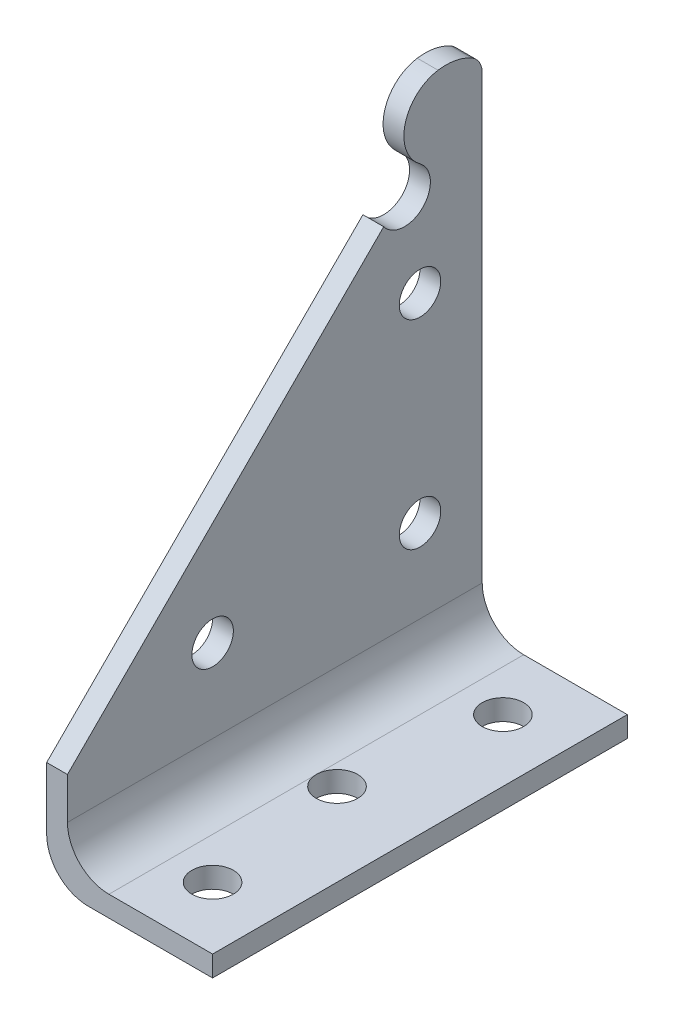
ISO-10303-21;
HEADER;
FILE_DESCRIPTION(('STEP AP214'),'2;1');
FILE_NAME('part.step','',(''),(''),'','','');
FILE_SCHEMA(('AUTOMOTIVE_DESIGN { 1 0 10303 214 1 1 1 1 }'));
ENDSEC;
DATA;
#1=APPLICATION_CONTEXT('core data for automotive mechanical design processes');
#2=APPLICATION_PROTOCOL_DEFINITION('international standard','automotive_design',2000,#1);
#3=PRODUCT_CONTEXT('',#1,'mechanical');
#4=PRODUCT('Part','Part','',(#3));
#5=PRODUCT_RELATED_PRODUCT_CATEGORY('part','',(#4));
#6=PRODUCT_DEFINITION_FORMATION('','',#4);
#7=PRODUCT_DEFINITION_CONTEXT('part definition',#1,'design');
#8=PRODUCT_DEFINITION('design','',#6,#7);
#9=PRODUCT_DEFINITION_SHAPE('','',#8);
#10=(LENGTH_UNIT() NAMED_UNIT(*) SI_UNIT(.MILLI.,.METRE.));
#11=(NAMED_UNIT(*) PLANE_ANGLE_UNIT() SI_UNIT($,.RADIAN.));
#12=(NAMED_UNIT(*) SI_UNIT($,.STERADIAN.) SOLID_ANGLE_UNIT());
#13=UNCERTAINTY_MEASURE_WITH_UNIT(LENGTH_MEASURE(1.E-05),#10,'distance_accuracy_value','');
#14=(GEOMETRIC_REPRESENTATION_CONTEXT(3) GLOBAL_UNCERTAINTY_ASSIGNED_CONTEXT((#13)) GLOBAL_UNIT_ASSIGNED_CONTEXT((#10,
#11,#12)) REPRESENTATION_CONTEXT('',''));
#15=CARTESIAN_POINT('',(0.,0.,0.));
#16=DIRECTION('',(0.,0.,1.));
#17=DIRECTION('',(1.,0.,0.));
#18=AXIS2_PLACEMENT_3D('',#15,#16,#17);
#19=CARTESIAN_POINT('',(3.18262,81.28,-31.75));
#20=DIRECTION('',(-1.,0.,0.));
#21=DIRECTION('',(0.,-1.,0.));
#22=AXIS2_PLACEMENT_3D('',#19,#20,#21);
#23=PLANE('',#22);
#24=CARTESIAN_POINT('',(3.18262000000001,22.225,9.525));
#25=DIRECTION('',(-1.,0.,0.));
#26=DIRECTION('',(0.,1.,0.));
#27=AXIS2_PLACEMENT_3D('',#24,#25,#26);
#28=CIRCLE('',#27,3.175);
#29=CARTESIAN_POINT('',(3.18262000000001,25.4,9.525));
#30=VERTEX_POINT('',#29);
#31=EDGE_CURVE('E520',#30,#30,#28,.T.);
#32=ORIENTED_EDGE('',*,*,#31,.T.);
#33=EDGE_LOOP('',(#32));
#34=FACE_BOUND('',#33,.T.);
#35=CARTESIAN_POINT('',(3.18262000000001,22.225,-22.225));
#36=DIRECTION('',(-1.,0.,0.));
#37=DIRECTION('',(0.,1.,0.));
#38=AXIS2_PLACEMENT_3D('',#35,#36,#37);
#39=CIRCLE('',#38,3.175);
#40=CARTESIAN_POINT('',(3.18262000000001,25.4,-22.225));
#41=VERTEX_POINT('',#40);
#42=EDGE_CURVE('E527',#41,#41,#39,.T.);
#43=ORIENTED_EDGE('',*,*,#42,.T.);
#44=EDGE_LOOP('',(#43));
#45=FACE_BOUND('',#44,.T.);
#46=CARTESIAN_POINT('',(3.18262,52.705,-22.225));
#47=DIRECTION('',(-1.,0.,0.));
#48=DIRECTION('',(0.,1.,0.));
#49=AXIS2_PLACEMENT_3D('',#46,#47,#48);
#50=CIRCLE('',#49,3.175);
#51=CARTESIAN_POINT('',(3.18262,55.88,-22.225));
#52=VERTEX_POINT('',#51);
#53=EDGE_CURVE('E532',#52,#52,#50,.T.);
#54=ORIENTED_EDGE('',*,*,#53,.T.);
#55=EDGE_LOOP('',(#54));
#56=FACE_BOUND('',#55,.T.);
#57=DIRECTION('',(0.,0.707106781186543,-0.707106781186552));
#58=VECTOR('',#57,1.);
#59=CARTESIAN_POINT('',(3.18262000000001,23.8125000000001,23.8124999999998));
#60=LINE('',#59,#58);
#61=CARTESIAN_POINT('',(3.18262000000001,15.875,31.75));
#62=VERTEX_POINT('',#61);
#63=CARTESIAN_POINT('',(3.18262,64.2944757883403,-16.6694757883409));
#64=VERTEX_POINT('',#63);
#65=EDGE_CURVE('E259',#62,#64,#60,.T.);
#66=ORIENTED_EDGE('',*,*,#65,.F.);
#67=DIRECTION('',(0.,1.,0.));
#68=VECTOR('',#67,1.);
#69=CARTESIAN_POINT('',(3.18262,81.28,31.75));
#70=LINE('',#69,#68);
#71=CARTESIAN_POINT('',(3.18262000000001,9.52499999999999,31.75));
#72=VERTEX_POINT('',#71);
#73=EDGE_CURVE('E257',#72,#62,#70,.T.);
#74=ORIENTED_EDGE('',*,*,#73,.F.);
#75=DIRECTION('',(0.,0.,1.));
#76=VECTOR('',#75,1.);
#77=CARTESIAN_POINT('',(3.18262000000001,9.52499999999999,31.75));
#78=LINE('',#77,#76);
#79=CARTESIAN_POINT('',(3.18262000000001,9.52499999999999,-31.75));
#80=VERTEX_POINT('',#79);
#81=EDGE_CURVE('E231',#80,#72,#78,.T.);
#82=ORIENTED_EDGE('',*,*,#81,.F.);
#83=DIRECTION('',(0.,1.,0.));
#84=VECTOR('',#83,1.);
#85=CARTESIAN_POINT('',(3.18262,81.28,-31.75));
#86=LINE('',#85,#84);
#87=CARTESIAN_POINT('',(3.18262,77.1624497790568,-31.75));
#88=VERTEX_POINT('',#87);
#89=EDGE_CURVE('E247',#80,#88,#86,.T.);
#90=ORIENTED_EDGE('',*,*,#89,.T.);
#91=CARTESIAN_POINT('',(3.18262,77.1624497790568,-28.570879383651));
#92=DIRECTION('',(-1.,0.,0.));
#93=DIRECTION('',(0.,1.,0.));
#94=AXIS2_PLACEMENT_3D('',#91,#92,#93);
#95=CIRCLE('',#94,3.17912061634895);
#96=CARTESIAN_POINT('',(3.18262,79.9193630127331,-30.1539893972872));
#97=VERTEX_POINT('',#96);
#98=EDGE_CURVE('E337',#97,#88,#95,.T.);
#99=ORIENTED_EDGE('',*,*,#98,.F.);
#100=CARTESIAN_POINT('',(3.18262,73.025,-26.19502));
#101=DIRECTION('',(-1.,0.,0.));
#102=DIRECTION('',(0.,1.,0.));
#103=AXIS2_PLACEMENT_3D('',#100,#101,#102);
#104=CIRCLE('',#103,7.9502);
#105=CARTESIAN_POINT('',(3.18262,80.8837240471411,-24.9924658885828));
#106=VERTEX_POINT('',#105);
#107=EDGE_CURVE('E340',#106,#97,#104,.T.);
#108=ORIENTED_EDGE('',*,*,#107,.F.);
#109=CARTESIAN_POINT('',(3.18262,74.7861943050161,-25.9255193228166));
#110=DIRECTION('',(-1.,0.,0.));
#111=DIRECTION('',(0.,1.,0.));
#112=AXIS2_PLACEMENT_3D('',#109,#110,#111);
#113=CIRCLE('',#112,6.16850530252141);
#114=CARTESIAN_POINT('',(3.18262,69.8505442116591,-22.2255442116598));
#115=VERTEX_POINT('',#114);
#116=EDGE_CURVE('E343',#115,#106,#113,.T.);
#117=ORIENTED_EDGE('',*,*,#116,.F.);
#118=CARTESIAN_POINT('',(3.18262,66.675,-19.84502));
#119=DIRECTION('',(-1.,0.,0.));
#120=DIRECTION('',(0.,1.,0.));
#121=AXIS2_PLACEMENT_3D('',#118,#119,#120);
#122=CIRCLE('',#121,3.96874999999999);
#123=EDGE_CURVE('E328',#115,#64,#122,.T.);
#124=ORIENTED_EDGE('',*,*,#123,.T.);
#125=EDGE_LOOP('',(#66,#74,#82,#90,#99,#108,#117,#124));
#126=FACE_BOUND('',#125,.T.);
#127=ADVANCED_FACE('F117',(#34,#45,#56,#126),#23,.F.);
#128=CARTESIAN_POINT('',(0.,0.,-31.75));
#129=DIRECTION('',(1.,0.,0.));
#130=DIRECTION('',(0.,0.,1.));
#131=AXIS2_PLACEMENT_3D('',#128,#129,#130);
#132=PLANE('',#131);
#133=CARTESIAN_POINT('',(0.,22.225,9.525));
#134=DIRECTION('',(-1.,0.,0.));
#135=DIRECTION('',(0.,1.,0.));
#136=AXIS2_PLACEMENT_3D('',#133,#134,#135);
#137=CIRCLE('',#136,3.175);
#138=CARTESIAN_POINT('',(0.,25.4,9.525));
#139=VERTEX_POINT('',#138);
#140=EDGE_CURVE('E524',#139,#139,#137,.T.);
#141=ORIENTED_EDGE('',*,*,#140,.F.);
#142=EDGE_LOOP('',(#141));
#143=FACE_BOUND('',#142,.T.);
#144=CARTESIAN_POINT('',(0.,22.225,-22.225));
#145=DIRECTION('',(-1.,0.,0.));
#146=DIRECTION('',(0.,1.,0.));
#147=AXIS2_PLACEMENT_3D('',#144,#145,#146);
#148=CIRCLE('',#147,3.175);
#149=CARTESIAN_POINT('',(0.,25.4,-22.225));
#150=VERTEX_POINT('',#149);
#151=EDGE_CURVE('E529',#150,#150,#148,.T.);
#152=ORIENTED_EDGE('',*,*,#151,.F.);
#153=EDGE_LOOP('',(#152));
#154=FACE_BOUND('',#153,.T.);
#155=CARTESIAN_POINT('',(0.,52.705,-22.225));
#156=DIRECTION('',(-1.,0.,0.));
#157=DIRECTION('',(0.,1.,0.));
#158=AXIS2_PLACEMENT_3D('',#155,#156,#157);
#159=CIRCLE('',#158,3.175);
#160=CARTESIAN_POINT('',(0.,55.88,-22.225));
#161=VERTEX_POINT('',#160);
#162=EDGE_CURVE('E338',#161,#161,#159,.T.);
#163=ORIENTED_EDGE('',*,*,#162,.F.);
#164=EDGE_LOOP('',(#163));
#165=FACE_BOUND('',#164,.T.);
#166=DIRECTION('',(0.,0.707106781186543,-0.707106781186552));
#167=VECTOR('',#166,1.);
#168=CARTESIAN_POINT('',(0.,23.8125000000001,23.8124999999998));
#169=LINE('',#168,#167);
#170=CARTESIAN_POINT('',(0.,15.875,31.75));
#171=VERTEX_POINT('',#170);
#172=CARTESIAN_POINT('',(0.,64.2944757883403,-16.6694757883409));
#173=VERTEX_POINT('',#172);
#174=EDGE_CURVE('E324',#171,#173,#169,.T.);
#175=ORIENTED_EDGE('',*,*,#174,.T.);
#176=CARTESIAN_POINT('',(0.,66.675,-19.84502));
#177=DIRECTION('',(-1.,0.,0.));
#178=DIRECTION('',(0.,1.,0.));
#179=AXIS2_PLACEMENT_3D('',#176,#177,#178);
#180=CIRCLE('',#179,3.96874999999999);
#181=CARTESIAN_POINT('',(0.,69.8505442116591,-22.2255442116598));
#182=VERTEX_POINT('',#181);
#183=EDGE_CURVE('E333',#182,#173,#180,.T.);
#184=ORIENTED_EDGE('',*,*,#183,.F.);
#185=CARTESIAN_POINT('',(0.,74.7861943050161,-25.9255193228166));
#186=DIRECTION('',(-1.,0.,0.));
#187=DIRECTION('',(0.,1.,0.));
#188=AXIS2_PLACEMENT_3D('',#185,#186,#187);
#189=CIRCLE('',#188,6.16850530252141);
#190=CARTESIAN_POINT('',(0.,80.8837240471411,-24.9924658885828));
#191=VERTEX_POINT('',#190);
#192=EDGE_CURVE('E326',#182,#191,#189,.T.);
#193=ORIENTED_EDGE('',*,*,#192,.T.);
#194=CARTESIAN_POINT('',(0.,73.025,-26.19502));
#195=DIRECTION('',(-1.,0.,0.));
#196=DIRECTION('',(0.,1.,0.));
#197=AXIS2_PLACEMENT_3D('',#194,#195,#196);
#198=CIRCLE('',#197,7.9502);
#199=CARTESIAN_POINT('',(0.,79.9193630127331,-30.1539893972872));
#200=VERTEX_POINT('',#199);
#201=EDGE_CURVE('E322',#191,#200,#198,.T.);
#202=ORIENTED_EDGE('',*,*,#201,.T.);
#203=CARTESIAN_POINT('',(0.,77.1624497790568,-28.570879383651));
#204=DIRECTION('',(-1.,0.,0.));
#205=DIRECTION('',(0.,1.,0.));
#206=AXIS2_PLACEMENT_3D('',#203,#204,#205);
#207=CIRCLE('',#206,3.17912061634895);
#208=CARTESIAN_POINT('',(0.,77.1624497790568,-31.75));
#209=VERTEX_POINT('',#208);
#210=EDGE_CURVE('E319',#200,#209,#207,.T.);
#211=ORIENTED_EDGE('',*,*,#210,.T.);
#212=DIRECTION('',(0.,-1.,0.));
#213=VECTOR('',#212,1.);
#214=CARTESIAN_POINT('',(0.,0.,-31.75));
#215=LINE('',#214,#213);
#216=CARTESIAN_POINT('',(0.,6.35,-31.75));
#217=VERTEX_POINT('',#216);
#218=EDGE_CURVE('E254',#209,#217,#215,.T.);
#219=ORIENTED_EDGE('',*,*,#218,.T.);
#220=DIRECTION('',(0.,0.,1.));
#221=VECTOR('',#220,1.);
#222=CARTESIAN_POINT('',(0.,6.35,-31.75));
#223=LINE('',#222,#221);
#224=CARTESIAN_POINT('',(0.,6.35,31.75));
#225=VERTEX_POINT('',#224);
#226=EDGE_CURVE('E280',#225,#217,#223,.F.);
#227=ORIENTED_EDGE('',*,*,#226,.F.);
#228=DIRECTION('',(0.,-1.,0.));
#229=VECTOR('',#228,1.);
#230=CARTESIAN_POINT('',(0.,0.,31.75));
#231=LINE('',#230,#229);
#232=EDGE_CURVE('E261',#171,#225,#231,.T.);
#233=ORIENTED_EDGE('',*,*,#232,.F.);
#234=EDGE_LOOP('',(#175,#184,#193,#202,#211,#219,#227,#233));
#235=FACE_BOUND('',#234,.T.);
#236=ADVANCED_FACE('F315',(#143,#154,#165,#235),#132,.F.);
#237=CARTESIAN_POINT('',(0.,0.,-31.75));
#238=DIRECTION('',(0.,0.,1.));
#239=DIRECTION('',(-1.,0.,0.));
#240=AXIS2_PLACEMENT_3D('',#237,#238,#239);
#241=PLANE('',#240);
#242=DIRECTION('',(1.,0.,0.));
#243=VECTOR('',#242,1.);
#244=CARTESIAN_POINT('',(0.,77.1624497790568,-31.75));
#245=LINE('',#244,#243);
#246=EDGE_CURVE('E250',#209,#88,#245,.T.);
#247=ORIENTED_EDGE('',*,*,#246,.T.);
#248=ORIENTED_EDGE('',*,*,#89,.F.);
#249=CARTESIAN_POINT('',(9.53262000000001,9.52499999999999,-31.75));
#250=DIRECTION('',(0.,0.,-1.));
#251=DIRECTION('',(-1.,0.,0.));
#252=AXIS2_PLACEMENT_3D('',#249,#250,#251);
#253=CIRCLE('',#252,6.35);
#254=CARTESIAN_POINT('',(9.53262000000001,3.175,-31.75));
#255=VERTEX_POINT('',#254);
#256=EDGE_CURVE('E128',#255,#80,#253,.T.);
#257=ORIENTED_EDGE('',*,*,#256,.F.);
#258=DIRECTION('',(-1.,0.,0.));
#259=VECTOR('',#258,1.);
#260=CARTESIAN_POINT('',(3.18262000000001,3.175,-31.75));
#261=LINE('',#260,#259);
#262=CARTESIAN_POINT('',(25.4,3.175,-31.75));
#263=VERTEX_POINT('',#262);
#264=EDGE_CURVE('E229',#263,#255,#261,.T.);
#265=ORIENTED_EDGE('',*,*,#264,.F.);
#266=DIRECTION('',(0.,1.,0.));
#267=VECTOR('',#266,1.);
#268=CARTESIAN_POINT('',(25.4,3.175,-31.75));
#269=LINE('',#268,#267);
#270=CARTESIAN_POINT('',(25.4,0.,-31.75));
#271=VERTEX_POINT('',#270);
#272=EDGE_CURVE('E292',#271,#263,#269,.T.);
#273=ORIENTED_EDGE('',*,*,#272,.F.);
#274=DIRECTION('',(1.,0.,0.));
#275=VECTOR('',#274,1.);
#276=CARTESIAN_POINT('',(25.4,0.,-31.75));
#277=LINE('',#276,#275);
#278=CARTESIAN_POINT('',(6.35,0.,-31.75));
#279=VERTEX_POINT('',#278);
#280=EDGE_CURVE('E265',#279,#271,#277,.T.);
#281=ORIENTED_EDGE('',*,*,#280,.F.);
#282=CARTESIAN_POINT('',(6.35,6.35,-31.75));
#283=DIRECTION('',(0.,0.,-1.));
#284=DIRECTION('',(-1.,0.,0.));
#285=AXIS2_PLACEMENT_3D('',#282,#283,#284);
#286=CIRCLE('',#285,6.35);
#287=EDGE_CURVE('E234',#217,#279,#286,.F.);
#288=ORIENTED_EDGE('',*,*,#287,.F.);
#289=ORIENTED_EDGE('',*,*,#218,.F.);
#290=EDGE_LOOP('',(#247,#248,#257,#265,#273,#281,#288,#289));
#291=FACE_BOUND('',#290,.T.);
#292=ADVANCED_FACE('F248',(#291),#241,.F.);
#293=CARTESIAN_POINT('',(0.,0.,31.75));
#294=DIRECTION('',(0.,0.,1.));
#295=DIRECTION('',(-1.,0.,0.));
#296=AXIS2_PLACEMENT_3D('',#293,#294,#295);
#297=PLANE('',#296);
#298=ORIENTED_EDGE('',*,*,#232,.T.);
#299=CARTESIAN_POINT('',(6.35,6.35,31.75));
#300=DIRECTION('',(0.,0.,-1.));
#301=DIRECTION('',(-1.,0.,0.));
#302=AXIS2_PLACEMENT_3D('',#299,#300,#301);
#303=CIRCLE('',#302,6.35);
#304=CARTESIAN_POINT('',(6.35,0.,31.75));
#305=VERTEX_POINT('',#304);
#306=EDGE_CURVE('E278',#305,#225,#303,.T.);
#307=ORIENTED_EDGE('',*,*,#306,.F.);
#308=DIRECTION('',(1.,0.,0.));
#309=VECTOR('',#308,1.);
#310=CARTESIAN_POINT('',(25.4,0.,31.75));
#311=LINE('',#310,#309);
#312=CARTESIAN_POINT('',(25.4,0.,31.75));
#313=VERTEX_POINT('',#312);
#314=EDGE_CURVE('E301',#305,#313,#311,.T.);
#315=ORIENTED_EDGE('',*,*,#314,.T.);
#316=DIRECTION('',(0.,1.,0.));
#317=VECTOR('',#316,1.);
#318=CARTESIAN_POINT('',(25.4,3.175,31.75));
#319=LINE('',#318,#317);
#320=CARTESIAN_POINT('',(25.4,3.175,31.75));
#321=VERTEX_POINT('',#320);
#322=EDGE_CURVE('E268',#313,#321,#319,.T.);
#323=ORIENTED_EDGE('',*,*,#322,.T.);
#324=DIRECTION('',(-1.,0.,0.));
#325=VECTOR('',#324,1.);
#326=CARTESIAN_POINT('',(3.18262000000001,3.175,31.75));
#327=LINE('',#326,#325);
#328=CARTESIAN_POINT('',(9.53262000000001,3.175,31.75));
#329=VERTEX_POINT('',#328);
#330=EDGE_CURVE('E262',#321,#329,#327,.T.);
#331=ORIENTED_EDGE('',*,*,#330,.T.);
#332=CARTESIAN_POINT('',(9.53262000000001,9.52499999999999,31.75));
#333=DIRECTION('',(0.,0.,-1.));
#334=DIRECTION('',(-1.,0.,0.));
#335=AXIS2_PLACEMENT_3D('',#332,#333,#334);
#336=CIRCLE('',#335,6.35);
#337=EDGE_CURVE('E232',#72,#329,#336,.F.);
#338=ORIENTED_EDGE('',*,*,#337,.F.);
#339=ORIENTED_EDGE('',*,*,#73,.T.);
#340=DIRECTION('',(1.,0.,0.));
#341=VECTOR('',#340,1.);
#342=CARTESIAN_POINT('',(0.,15.875,31.75));
#343=LINE('',#342,#341);
#344=EDGE_CURVE('E141',#171,#62,#343,.T.);
#345=ORIENTED_EDGE('',*,*,#344,.F.);
#346=EDGE_LOOP('',(#298,#307,#315,#323,#331,#338,#339,#345));
#347=FACE_BOUND('',#346,.T.);
#348=ADVANCED_FACE('F306',(#347),#297,.T.);
#349=CARTESIAN_POINT('',(25.4,0.,-31.75));
#350=DIRECTION('',(0.,1.,0.));
#351=DIRECTION('',(-1.,0.,0.));
#352=AXIS2_PLACEMENT_3D('',#349,#350,#351);
#353=PLANE('',#352);
#354=CARTESIAN_POINT('',(15.875,0.,22.225));
#355=DIRECTION('',(0.,-1.,0.));
#356=DIRECTION('',(-1.,0.,0.));
#357=AXIS2_PLACEMENT_3D('',#354,#355,#356);
#358=CIRCLE('',#357,3.175);
#359=CARTESIAN_POINT('',(12.7,0.,22.225));
#360=VERTEX_POINT('',#359);
#361=EDGE_CURVE('E225',#360,#360,#358,.T.);
#362=ORIENTED_EDGE('',*,*,#361,.F.);
#363=EDGE_LOOP('',(#362));
#364=FACE_BOUND('',#363,.T.);
#365=CARTESIAN_POINT('',(12.7,0.,0.));
#366=DIRECTION('',(0.,-1.,0.));
#367=DIRECTION('',(-1.,0.,0.));
#368=AXIS2_PLACEMENT_3D('',#365,#366,#367);
#369=CIRCLE('',#368,3.175);
#370=CARTESIAN_POINT('',(9.525,0.,0.));
#371=VERTEX_POINT('',#370);
#372=EDGE_CURVE('E224',#371,#371,#369,.T.);
#373=ORIENTED_EDGE('',*,*,#372,.F.);
#374=EDGE_LOOP('',(#373));
#375=FACE_BOUND('',#374,.T.);
#376=CARTESIAN_POINT('',(15.875,0.,-22.225));
#377=DIRECTION('',(0.,-1.,0.));
#378=DIRECTION('',(-1.,0.,0.));
#379=AXIS2_PLACEMENT_3D('',#376,#377,#378);
#380=CIRCLE('',#379,3.175);
#381=CARTESIAN_POINT('',(12.7,0.,-22.225));
#382=VERTEX_POINT('',#381);
#383=EDGE_CURVE('E517',#382,#382,#380,.T.);
#384=ORIENTED_EDGE('',*,*,#383,.F.);
#385=EDGE_LOOP('',(#384));
#386=FACE_BOUND('',#385,.T.);
#387=ORIENTED_EDGE('',*,*,#280,.T.);
#388=DIRECTION('',(0.,0.,1.));
#389=VECTOR('',#388,1.);
#390=CARTESIAN_POINT('',(25.4,0.,-31.75));
#391=LINE('',#390,#389);
#392=EDGE_CURVE('E274',#271,#313,#391,.T.);
#393=ORIENTED_EDGE('',*,*,#392,.T.);
#394=ORIENTED_EDGE('',*,*,#314,.F.);
#395=DIRECTION('',(0.,0.,1.));
#396=VECTOR('',#395,1.);
#397=CARTESIAN_POINT('',(6.35,0.,-31.75));
#398=LINE('',#397,#396);
#399=EDGE_CURVE('E276',#279,#305,#398,.T.);
#400=ORIENTED_EDGE('',*,*,#399,.F.);
#401=EDGE_LOOP('',(#387,#393,#394,#400));
#402=FACE_BOUND('',#401,.T.);
#403=ADVANCED_FACE('F311',(#364,#375,#386,#402),#353,.F.);
#404=CARTESIAN_POINT('',(25.4,3.175,-31.75));
#405=DIRECTION('',(-1.,0.,0.));
#406=DIRECTION('',(0.,0.,-1.));
#407=AXIS2_PLACEMENT_3D('',#404,#405,#406);
#408=PLANE('',#407);
#409=ORIENTED_EDGE('',*,*,#322,.F.);
#410=ORIENTED_EDGE('',*,*,#392,.F.);
#411=ORIENTED_EDGE('',*,*,#272,.T.);
#412=DIRECTION('',(0.,0.,1.));
#413=VECTOR('',#412,1.);
#414=CARTESIAN_POINT('',(25.4,3.175,-31.75));
#415=LINE('',#414,#413);
#416=EDGE_CURVE('E272',#263,#321,#415,.T.);
#417=ORIENTED_EDGE('',*,*,#416,.T.);
#418=EDGE_LOOP('',(#409,#410,#411,#417));
#419=FACE_BOUND('',#418,.T.);
#420=ADVANCED_FACE('F310',(#419),#408,.F.);
#421=CARTESIAN_POINT('',(3.18262000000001,3.175,-31.75));
#422=DIRECTION('',(0.,-1.,0.));
#423=DIRECTION('',(1.,0.,0.));
#424=AXIS2_PLACEMENT_3D('',#421,#422,#423);
#425=PLANE('',#424);
#426=CARTESIAN_POINT('',(15.875,3.175,22.225));
#427=DIRECTION('',(0.,-1.,0.));
#428=DIRECTION('',(-1.,0.,0.));
#429=AXIS2_PLACEMENT_3D('',#426,#427,#428);
#430=CIRCLE('',#429,3.175);
#431=CARTESIAN_POINT('',(12.7,3.175,22.225));
#432=VERTEX_POINT('',#431);
#433=EDGE_CURVE('E554',#432,#432,#430,.T.);
#434=ORIENTED_EDGE('',*,*,#433,.T.);
#435=EDGE_LOOP('',(#434));
#436=FACE_BOUND('',#435,.T.);
#437=CARTESIAN_POINT('',(15.875,3.175,-22.225));
#438=DIRECTION('',(0.,-1.,0.));
#439=DIRECTION('',(-1.,0.,0.));
#440=AXIS2_PLACEMENT_3D('',#437,#438,#439);
#441=CIRCLE('',#440,3.175);
#442=CARTESIAN_POINT('',(12.7,3.175,-22.225));
#443=VERTEX_POINT('',#442);
#444=EDGE_CURVE('E521',#443,#443,#441,.T.);
#445=ORIENTED_EDGE('',*,*,#444,.T.);
#446=EDGE_LOOP('',(#445));
#447=FACE_BOUND('',#446,.T.);
#448=DIRECTION('',(0.,0.,1.));
#449=VECTOR('',#448,1.);
#450=CARTESIAN_POINT('',(9.53262000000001,3.175,-31.75));
#451=LINE('',#450,#449);
#452=CARTESIAN_POINT('',(9.53262000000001,3.175,0.219838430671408));
#453=VERTEX_POINT('',#452);
#454=EDGE_CURVE('E122',#329,#453,#451,.F.);
#455=ORIENTED_EDGE('',*,*,#454,.F.);
#456=ORIENTED_EDGE('',*,*,#330,.F.);
#457=ORIENTED_EDGE('',*,*,#416,.F.);
#458=ORIENTED_EDGE('',*,*,#264,.T.);
#459=CARTESIAN_POINT('',(9.53262000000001,3.175,-0.21983843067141));
#460=VERTEX_POINT('',#459);
#461=EDGE_CURVE('E216',#460,#255,#451,.F.);
#462=ORIENTED_EDGE('',*,*,#461,.F.);
#463=CARTESIAN_POINT('',(12.7,3.175,0.));
#464=DIRECTION('',(0.,-1.,0.));
#465=DIRECTION('',(-1.,0.,0.));
#466=AXIS2_PLACEMENT_3D('',#463,#464,#465);
#467=CIRCLE('',#466,3.175);
#468=EDGE_CURVE('E221',#460,#453,#467,.T.);
#469=ORIENTED_EDGE('',*,*,#468,.T.);
#470=EDGE_LOOP('',(#455,#456,#457,#458,#462,#469));
#471=FACE_BOUND('',#470,.T.);
#472=ADVANCED_FACE('F227',(#436,#447,#471),#425,.F.);
#473=CARTESIAN_POINT('',(6.35,6.35,-31.75));
#474=DIRECTION('',(0.,0.,1.));
#475=DIRECTION('',(-1.,0.,0.));
#476=AXIS2_PLACEMENT_3D('',#473,#474,#475);
#477=CYLINDRICAL_SURFACE('',#476,6.35);
#478=ORIENTED_EDGE('',*,*,#287,.T.);
#479=ORIENTED_EDGE('',*,*,#399,.T.);
#480=ORIENTED_EDGE('',*,*,#306,.T.);
#481=ORIENTED_EDGE('',*,*,#226,.T.);
#482=EDGE_LOOP('',(#478,#479,#480,#481));
#483=FACE_BOUND('',#482,.T.);
#484=ADVANCED_FACE('F285',(#483),#477,.T.);
#485=CARTESIAN_POINT('',(9.53262000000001,9.52499999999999,-31.75));
#486=DIRECTION('',(0.,0.,-1.));
#487=DIRECTION('',(1.,0.,0.));
#488=AXIS2_PLACEMENT_3D('',#485,#486,#487);
#489=CYLINDRICAL_SURFACE('',#488,6.35);
#490=ORIENTED_EDGE('',*,*,#461,.T.);
#491=ORIENTED_EDGE('',*,*,#256,.T.);
#492=ORIENTED_EDGE('',*,*,#81,.T.);
#493=ORIENTED_EDGE('',*,*,#337,.T.);
#494=ORIENTED_EDGE('',*,*,#454,.T.);
#495=CARTESIAN_POINT('',(9.53262000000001,3.17499999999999,0.219838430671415));
#496=CARTESIAN_POINT('',(9.53134910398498,3.17500002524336,0.201528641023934));
#497=CARTESIAN_POINT('',(9.53023634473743,3.17500038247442,0.183207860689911));
#498=CARTESIAN_POINT('',(9.52832899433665,3.175001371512,0.146566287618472));
#499=CARTESIAN_POINT('',(9.52753411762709,3.17500200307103,0.128245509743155));
#500=CARTESIAN_POINT('',(9.52626251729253,3.17500315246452,0.0916039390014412));
#501=CARTESIAN_POINT('',(9.52578560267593,3.17500367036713,0.0732831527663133));
#502=CARTESIAN_POINT('',(9.5251498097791,3.17500438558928,0.0366415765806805));
#503=CARTESIAN_POINT('',(9.52499083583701,3.17500458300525,0.0183207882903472));
#504=CARTESIAN_POINT('',(9.52499083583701,3.17500458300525,-0.0183207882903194));
#505=CARTESIAN_POINT('',(9.5251498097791,3.17500438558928,-0.0366415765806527));
#506=CARTESIAN_POINT('',(9.52578560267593,3.17500367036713,-0.0732831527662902));
#507=CARTESIAN_POINT('',(9.52626251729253,3.17500315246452,-0.0916039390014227));
#508=CARTESIAN_POINT('',(9.52753411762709,3.17500200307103,-0.128245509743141));
#509=CARTESIAN_POINT('',(9.52832899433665,3.175001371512,-0.146566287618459));
#510=CARTESIAN_POINT('',(9.53023634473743,3.17500038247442,-0.183207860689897));
#511=CARTESIAN_POINT('',(9.53134910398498,3.17500002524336,-0.201528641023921));
#512=CARTESIAN_POINT('',(9.53262000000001,3.17499999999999,-0.219838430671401));
#513=B_SPLINE_CURVE_WITH_KNOTS('',3,(#495,#496,#497,#498,#499,#500,#501,#502,#503,#504,#505,
#506,#507,#508,#509,#510,#511,#512),.UNSPECIFIED.,.F.,.F.,(4,2,2,2,2,2,2,2,4),(0.,
0.0550608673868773,0.11007216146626,0.165050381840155,0.220012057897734,0.274973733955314,
0.329951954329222,0.384963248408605,0.440024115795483),.UNSPECIFIED.);
#514=EDGE_CURVE('E12',#453,#460,#513,.T.);
#515=ORIENTED_EDGE('',*,*,#514,.T.);
#516=EDGE_LOOP('',(#490,#491,#492,#493,#494,#515));
#517=FACE_BOUND('',#516,.T.);
#518=ADVANCED_FACE('F119',(#517),#489,.F.);
#519=CARTESIAN_POINT('',(0.,23.8125000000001,23.8124999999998));
#520=DIRECTION('',(0.,0.707106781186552,0.707106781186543));
#521=DIRECTION('',(0.,0.707106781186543,-0.707106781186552));
#522=AXIS2_PLACEMENT_3D('',#519,#520,#521);
#523=PLANE('',#522);
#524=ORIENTED_EDGE('',*,*,#65,.T.);
#525=DIRECTION('',(1.,0.,0.));
#526=VECTOR('',#525,1.);
#527=CARTESIAN_POINT('',(0.,64.2944757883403,-16.6694757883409));
#528=LINE('',#527,#526);
#529=EDGE_CURVE('E303',#173,#64,#528,.T.);
#530=ORIENTED_EDGE('',*,*,#529,.F.);
#531=ORIENTED_EDGE('',*,*,#174,.F.);
#532=ORIENTED_EDGE('',*,*,#344,.T.);
#533=EDGE_LOOP('',(#524,#530,#531,#532));
#534=FACE_BOUND('',#533,.T.);
#535=ADVANCED_FACE('F365',(#534),#523,.T.);
#536=CARTESIAN_POINT('',(0.,66.675,-19.84502));
#537=DIRECTION('',(1.,0.,0.));
#538=DIRECTION('',(0.,1.,0.));
#539=AXIS2_PLACEMENT_3D('',#536,#537,#538);
#540=CYLINDRICAL_SURFACE('',#539,3.96874999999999);
#541=ORIENTED_EDGE('',*,*,#123,.F.);
#542=DIRECTION('',(1.,0.,0.));
#543=VECTOR('',#542,1.);
#544=CARTESIAN_POINT('',(0.,69.8505442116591,-22.2255442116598));
#545=LINE('',#544,#543);
#546=EDGE_CURVE('E348',#182,#115,#545,.T.);
#547=ORIENTED_EDGE('',*,*,#546,.F.);
#548=ORIENTED_EDGE('',*,*,#183,.T.);
#549=ORIENTED_EDGE('',*,*,#529,.T.);
#550=EDGE_LOOP('',(#541,#547,#548,#549));
#551=FACE_BOUND('',#550,.T.);
#552=ADVANCED_FACE('F364',(#551),#540,.F.);
#553=CARTESIAN_POINT('',(0.,74.7861943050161,-25.9255193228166));
#554=DIRECTION('',(1.,0.,0.));
#555=DIRECTION('',(0.,1.,0.));
#556=AXIS2_PLACEMENT_3D('',#553,#554,#555);
#557=CYLINDRICAL_SURFACE('',#556,6.16850530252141);
#558=ORIENTED_EDGE('',*,*,#116,.T.);
#559=DIRECTION('',(1.,0.,0.));
#560=VECTOR('',#559,1.);
#561=CARTESIAN_POINT('',(0.,80.8837240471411,-24.9924658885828));
#562=LINE('',#561,#560);
#563=EDGE_CURVE('E350',#191,#106,#562,.T.);
#564=ORIENTED_EDGE('',*,*,#563,.F.);
#565=ORIENTED_EDGE('',*,*,#192,.F.);
#566=ORIENTED_EDGE('',*,*,#546,.T.);
#567=EDGE_LOOP('',(#558,#564,#565,#566));
#568=FACE_BOUND('',#567,.T.);
#569=ADVANCED_FACE('F360',(#568),#557,.T.);
#570=CARTESIAN_POINT('',(0.,73.025,-26.19502));
#571=DIRECTION('',(1.,0.,0.));
#572=DIRECTION('',(0.,1.,0.));
#573=AXIS2_PLACEMENT_3D('',#570,#571,#572);
#574=CYLINDRICAL_SURFACE('',#573,7.9502);
#575=ORIENTED_EDGE('',*,*,#107,.T.);
#576=DIRECTION('',(1.,0.,0.));
#577=VECTOR('',#576,1.);
#578=CARTESIAN_POINT('',(0.,79.9193630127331,-30.1539893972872));
#579=LINE('',#578,#577);
#580=EDGE_CURVE('E352',#200,#97,#579,.T.);
#581=ORIENTED_EDGE('',*,*,#580,.F.);
#582=ORIENTED_EDGE('',*,*,#201,.F.);
#583=ORIENTED_EDGE('',*,*,#563,.T.);
#584=EDGE_LOOP('',(#575,#581,#582,#583));
#585=FACE_BOUND('',#584,.T.);
#586=ADVANCED_FACE('F356',(#585),#574,.T.);
#587=CARTESIAN_POINT('',(0.,77.1624497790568,-28.570879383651));
#588=DIRECTION('',(1.,0.,0.));
#589=DIRECTION('',(0.,1.,0.));
#590=AXIS2_PLACEMENT_3D('',#587,#588,#589);
#591=CYLINDRICAL_SURFACE('',#590,3.17912061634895);
#592=ORIENTED_EDGE('',*,*,#98,.T.);
#593=ORIENTED_EDGE('',*,*,#246,.F.);
#594=ORIENTED_EDGE('',*,*,#210,.F.);
#595=ORIENTED_EDGE('',*,*,#580,.T.);
#596=EDGE_LOOP('',(#592,#593,#594,#595));
#597=FACE_BOUND('',#596,.T.);
#598=ADVANCED_FACE('F353',(#597),#591,.T.);
#599=CARTESIAN_POINT('',(0.,52.705,-22.225));
#600=DIRECTION('',(1.,0.,0.));
#601=DIRECTION('',(0.,1.,0.));
#602=AXIS2_PLACEMENT_3D('',#599,#600,#601);
#603=CYLINDRICAL_SURFACE('',#602,3.175);
#604=ORIENTED_EDGE('',*,*,#162,.T.);
#605=EDGE_LOOP('',(#604));
#606=FACE_BOUND('',#605,.T.);
#607=ORIENTED_EDGE('',*,*,#53,.F.);
#608=EDGE_LOOP('',(#607));
#609=FACE_BOUND('',#608,.T.);
#610=ADVANCED_FACE('F443',(#606,#609),#603,.F.);
#611=CARTESIAN_POINT('',(0.,22.225,-22.225));
#612=DIRECTION('',(1.,0.,0.));
#613=DIRECTION('',(0.,1.,0.));
#614=AXIS2_PLACEMENT_3D('',#611,#612,#613);
#615=CYLINDRICAL_SURFACE('',#614,3.175);
#616=ORIENTED_EDGE('',*,*,#151,.T.);
#617=EDGE_LOOP('',(#616));
#618=FACE_BOUND('',#617,.T.);
#619=ORIENTED_EDGE('',*,*,#42,.F.);
#620=EDGE_LOOP('',(#619));
#621=FACE_BOUND('',#620,.T.);
#622=ADVANCED_FACE('F450',(#618,#621),#615,.F.);
#623=CARTESIAN_POINT('',(0.,22.225,9.525));
#624=DIRECTION('',(1.,0.,0.));
#625=DIRECTION('',(0.,1.,0.));
#626=AXIS2_PLACEMENT_3D('',#623,#624,#625);
#627=CYLINDRICAL_SURFACE('',#626,3.175);
#628=ORIENTED_EDGE('',*,*,#140,.T.);
#629=EDGE_LOOP('',(#628));
#630=FACE_BOUND('',#629,.T.);
#631=ORIENTED_EDGE('',*,*,#31,.F.);
#632=EDGE_LOOP('',(#631));
#633=FACE_BOUND('',#632,.T.);
#634=ADVANCED_FACE('F460',(#630,#633),#627,.F.);
#635=CARTESIAN_POINT('',(15.875,0.,-22.225));
#636=DIRECTION('',(0.,1.,0.));
#637=DIRECTION('',(-1.,0.,0.));
#638=AXIS2_PLACEMENT_3D('',#635,#636,#637);
#639=CYLINDRICAL_SURFACE('',#638,3.175);
#640=CARTESIAN_POINT('',(12.7,0.,-22.225));
#641=CARTESIAN_POINT('',(12.7,0.0330729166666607,-22.225));
#642=CARTESIAN_POINT('',(12.7,0.0661458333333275,-22.225));
#643=CARTESIAN_POINT('',(12.7,0.132291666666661,-22.225));
#644=CARTESIAN_POINT('',(12.7,0.165364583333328,-22.225));
#645=CARTESIAN_POINT('',(12.7,0.231510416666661,-22.225));
#646=CARTESIAN_POINT('',(12.7,0.264583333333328,-22.225));
#647=CARTESIAN_POINT('',(12.7,0.330729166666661,-22.225));
#648=CARTESIAN_POINT('',(12.7,0.363802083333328,-22.225));
#649=CARTESIAN_POINT('',(12.7,0.429947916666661,-22.225));
#650=CARTESIAN_POINT('',(12.7,0.463020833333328,-22.225));
#651=CARTESIAN_POINT('',(12.7,0.529166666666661,-22.225));
#652=CARTESIAN_POINT('',(12.7,0.562239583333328,-22.225));
#653=CARTESIAN_POINT('',(12.7,0.628385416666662,-22.225));
#654=CARTESIAN_POINT('',(12.7,0.661458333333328,-22.225));
#655=CARTESIAN_POINT('',(12.7,0.727604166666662,-22.225));
#656=CARTESIAN_POINT('',(12.7,0.760677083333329,-22.225));
#657=CARTESIAN_POINT('',(12.7,0.826822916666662,-22.225));
#658=CARTESIAN_POINT('',(12.7,0.859895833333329,-22.225));
#659=CARTESIAN_POINT('',(12.7,0.926041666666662,-22.225));
#660=CARTESIAN_POINT('',(12.7,0.959114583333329,-22.225));
#661=CARTESIAN_POINT('',(12.7,1.02526041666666,-22.225));
#662=CARTESIAN_POINT('',(12.7,1.05833333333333,-22.225));
#663=CARTESIAN_POINT('',(12.7,1.12447916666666,-22.225));
#664=CARTESIAN_POINT('',(12.7,1.15755208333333,-22.225));
#665=CARTESIAN_POINT('',(12.7,1.22369791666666,-22.225));
#666=CARTESIAN_POINT('',(12.7,1.25677083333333,-22.225));
#667=CARTESIAN_POINT('',(12.7,1.32291666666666,-22.225));
#668=CARTESIAN_POINT('',(12.7,1.35598958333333,-22.225));
#669=CARTESIAN_POINT('',(12.7,1.42213541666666,-22.225));
#670=CARTESIAN_POINT('',(12.7,1.45520833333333,-22.225));
#671=CARTESIAN_POINT('',(12.7,1.52135416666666,-22.225));
#672=CARTESIAN_POINT('',(12.7,1.55442708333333,-22.225));
#673=CARTESIAN_POINT('',(12.7,1.62057291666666,-22.225));
#674=CARTESIAN_POINT('',(12.7,1.65364583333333,-22.225));
#675=CARTESIAN_POINT('',(12.7,1.71979166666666,-22.225));
#676=CARTESIAN_POINT('',(12.7,1.75286458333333,-22.225));
#677=CARTESIAN_POINT('',(12.7,1.81901041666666,-22.225));
#678=CARTESIAN_POINT('',(12.7,1.85208333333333,-22.225));
#679=CARTESIAN_POINT('',(12.7,1.91822916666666,-22.225));
#680=CARTESIAN_POINT('',(12.7,1.95130208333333,-22.225));
#681=CARTESIAN_POINT('',(12.7,2.01744791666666,-22.225));
#682=CARTESIAN_POINT('',(12.7,2.05052083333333,-22.225));
#683=CARTESIAN_POINT('',(12.7,2.11666666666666,-22.225));
#684=CARTESIAN_POINT('',(12.7,2.14973958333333,-22.225));
#685=CARTESIAN_POINT('',(12.7,2.21588541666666,-22.225));
#686=CARTESIAN_POINT('',(12.7,2.24895833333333,-22.225));
#687=CARTESIAN_POINT('',(12.7,2.31510416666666,-22.225));
#688=CARTESIAN_POINT('',(12.7,2.34817708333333,-22.225));
#689=CARTESIAN_POINT('',(12.7,2.41432291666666,-22.225));
#690=CARTESIAN_POINT('',(12.7,2.44739583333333,-22.225));
#691=CARTESIAN_POINT('',(12.7,2.51354166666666,-22.225));
#692=CARTESIAN_POINT('',(12.7,2.54661458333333,-22.225));
#693=CARTESIAN_POINT('',(12.7,2.61276041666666,-22.225));
#694=CARTESIAN_POINT('',(12.7,2.64583333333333,-22.225));
#695=CARTESIAN_POINT('',(12.7,2.71197916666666,-22.225));
#696=CARTESIAN_POINT('',(12.7,2.74505208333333,-22.225));
#697=CARTESIAN_POINT('',(12.7,2.81119791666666,-22.225));
#698=CARTESIAN_POINT('',(12.7,2.84427083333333,-22.225));
#699=CARTESIAN_POINT('',(12.7,2.91041666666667,-22.225));
#700=CARTESIAN_POINT('',(12.7,2.94348958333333,-22.225));
#701=CARTESIAN_POINT('',(12.7,3.00963541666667,-22.225));
#702=CARTESIAN_POINT('',(12.7,3.04270833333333,-22.225));
#703=CARTESIAN_POINT('',(12.7,3.10885416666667,-22.225));
#704=CARTESIAN_POINT('',(12.7,3.14192708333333,-22.225));
#705=CARTESIAN_POINT('',(12.7,3.175,-22.225));
#706=B_SPLINE_CURVE_WITH_KNOTS('',3,(#640,#641,#642,#643,#644,#645,#646,#647,#648,#649,#650,
#651,#652,#653,#654,#655,#656,#657,#658,#659,#660,#661,#662,#663,#664,#665,#666,#667,#668,#669,
#670,#671,#672,#673,#674,#675,#676,#677,#678,#679,#680,#681,#682,#683,#684,#685,#686,#687,#688,
#689,#690,#691,#692,#693,#694,#695,#696,#697,#698,#699,#700,#701,#702,#703,#704,#705),
.UNSPECIFIED.,.F.,.F.,(4,2,2,2,2,2,2,2,2,2,2,2,2,2,2,2,2,2,2,2,2,2,2,2,2,2,2,2,2,2,2,2,4),(0.,
0.0992187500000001,0.1984375,0.29765625,0.396875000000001,0.496093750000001,0.595312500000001,
0.694531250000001,0.793750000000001,0.892968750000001,0.992187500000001,1.09140625,1.190625,
1.28984375,1.3890625,1.48828125,1.5875,1.68671875,1.7859375,1.88515625,1.984375,2.08359375,
2.1828125,2.28203125,2.38125,2.48046875,2.5796875,2.67890625,2.778125,2.87734375,2.9765625,
3.07578125,3.175),.UNSPECIFIED.);
#707=EDGE_CURVE('BSEAM470',#382,#443,#706,.T.);
#708=ORIENTED_EDGE('',*,*,#383,.T.);
#709=ORIENTED_EDGE('',*,*,#444,.F.);
#710=ORIENTED_EDGE('',*,*,#707,.T.);
#711=ORIENTED_EDGE('',*,*,#707,.F.);
#712=EDGE_LOOP('',(#708,#710,#709,#711));
#713=FACE_BOUND('',#712,.T.);
#714=ADVANCED_FACE('F470',(#713),#639,.F.);
#715=CARTESIAN_POINT('',(12.7,0.,0.));
#716=DIRECTION('',(0.,1.,0.));
#717=DIRECTION('',(-1.,0.,0.));
#718=AXIS2_PLACEMENT_3D('',#715,#716,#717);
#719=CYLINDRICAL_SURFACE('',#718,3.175);
#720=ORIENTED_EDGE('',*,*,#372,.T.);
#721=EDGE_LOOP('',(#720));
#722=FACE_BOUND('',#721,.T.);
#723=ORIENTED_EDGE('',*,*,#468,.F.);
#724=ORIENTED_EDGE('',*,*,#514,.F.);
#725=EDGE_LOOP('',(#723,#724));
#726=FACE_BOUND('',#725,.T.);
#727=ADVANCED_FACE('F222',(#722,#726),#719,.F.);
#728=CARTESIAN_POINT('',(15.875,0.,22.225));
#729=DIRECTION('',(0.,1.,0.));
#730=DIRECTION('',(-1.,0.,0.));
#731=AXIS2_PLACEMENT_3D('',#728,#729,#730);
#732=CYLINDRICAL_SURFACE('',#731,3.175);
#733=CARTESIAN_POINT('',(12.7,0.,22.225));
#734=CARTESIAN_POINT('',(12.7,0.0330729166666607,22.225));
#735=CARTESIAN_POINT('',(12.7,0.0661458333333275,22.225));
#736=CARTESIAN_POINT('',(12.7,0.132291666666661,22.225));
#737=CARTESIAN_POINT('',(12.7,0.165364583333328,22.225));
#738=CARTESIAN_POINT('',(12.7,0.231510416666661,22.225));
#739=CARTESIAN_POINT('',(12.7,0.264583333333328,22.225));
#740=CARTESIAN_POINT('',(12.7,0.330729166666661,22.225));
#741=CARTESIAN_POINT('',(12.7,0.363802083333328,22.225));
#742=CARTESIAN_POINT('',(12.7,0.429947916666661,22.225));
#743=CARTESIAN_POINT('',(12.7,0.463020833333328,22.225));
#744=CARTESIAN_POINT('',(12.7,0.529166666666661,22.225));
#745=CARTESIAN_POINT('',(12.7,0.562239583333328,22.225));
#746=CARTESIAN_POINT('',(12.7,0.628385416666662,22.225));
#747=CARTESIAN_POINT('',(12.7,0.661458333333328,22.225));
#748=CARTESIAN_POINT('',(12.7,0.727604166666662,22.225));
#749=CARTESIAN_POINT('',(12.7,0.760677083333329,22.225));
#750=CARTESIAN_POINT('',(12.7,0.826822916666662,22.225));
#751=CARTESIAN_POINT('',(12.7,0.859895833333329,22.225));
#752=CARTESIAN_POINT('',(12.7,0.926041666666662,22.225));
#753=CARTESIAN_POINT('',(12.7,0.959114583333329,22.225));
#754=CARTESIAN_POINT('',(12.7,1.02526041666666,22.225));
#755=CARTESIAN_POINT('',(12.7,1.05833333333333,22.225));
#756=CARTESIAN_POINT('',(12.7,1.12447916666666,22.225));
#757=CARTESIAN_POINT('',(12.7,1.15755208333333,22.225));
#758=CARTESIAN_POINT('',(12.7,1.22369791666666,22.225));
#759=CARTESIAN_POINT('',(12.7,1.25677083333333,22.225));
#760=CARTESIAN_POINT('',(12.7,1.32291666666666,22.225));
#761=CARTESIAN_POINT('',(12.7,1.35598958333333,22.225));
#762=CARTESIAN_POINT('',(12.7,1.42213541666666,22.225));
#763=CARTESIAN_POINT('',(12.7,1.45520833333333,22.225));
#764=CARTESIAN_POINT('',(12.7,1.52135416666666,22.225));
#765=CARTESIAN_POINT('',(12.7,1.55442708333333,22.225));
#766=CARTESIAN_POINT('',(12.7,1.62057291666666,22.225));
#767=CARTESIAN_POINT('',(12.7,1.65364583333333,22.225));
#768=CARTESIAN_POINT('',(12.7,1.71979166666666,22.225));
#769=CARTESIAN_POINT('',(12.7,1.75286458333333,22.225));
#770=CARTESIAN_POINT('',(12.7,1.81901041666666,22.225));
#771=CARTESIAN_POINT('',(12.7,1.85208333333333,22.225));
#772=CARTESIAN_POINT('',(12.7,1.91822916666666,22.225));
#773=CARTESIAN_POINT('',(12.7,1.95130208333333,22.225));
#774=CARTESIAN_POINT('',(12.7,2.01744791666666,22.225));
#775=CARTESIAN_POINT('',(12.7,2.05052083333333,22.225));
#776=CARTESIAN_POINT('',(12.7,2.11666666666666,22.225));
#777=CARTESIAN_POINT('',(12.7,2.14973958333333,22.225));
#778=CARTESIAN_POINT('',(12.7,2.21588541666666,22.225));
#779=CARTESIAN_POINT('',(12.7,2.24895833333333,22.225));
#780=CARTESIAN_POINT('',(12.7,2.31510416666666,22.225));
#781=CARTESIAN_POINT('',(12.7,2.34817708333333,22.225));
#782=CARTESIAN_POINT('',(12.7,2.41432291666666,22.225));
#783=CARTESIAN_POINT('',(12.7,2.44739583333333,22.225));
#784=CARTESIAN_POINT('',(12.7,2.51354166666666,22.225));
#785=CARTESIAN_POINT('',(12.7,2.54661458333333,22.225));
#786=CARTESIAN_POINT('',(12.7,2.61276041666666,22.225));
#787=CARTESIAN_POINT('',(12.7,2.64583333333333,22.225));
#788=CARTESIAN_POINT('',(12.7,2.71197916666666,22.225));
#789=CARTESIAN_POINT('',(12.7,2.74505208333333,22.225));
#790=CARTESIAN_POINT('',(12.7,2.81119791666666,22.225));
#791=CARTESIAN_POINT('',(12.7,2.84427083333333,22.225));
#792=CARTESIAN_POINT('',(12.7,2.91041666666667,22.225));
#793=CARTESIAN_POINT('',(12.7,2.94348958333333,22.225));
#794=CARTESIAN_POINT('',(12.7,3.00963541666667,22.225));
#795=CARTESIAN_POINT('',(12.7,3.04270833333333,22.225));
#796=CARTESIAN_POINT('',(12.7,3.10885416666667,22.225));
#797=CARTESIAN_POINT('',(12.7,3.14192708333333,22.225));
#798=CARTESIAN_POINT('',(12.7,3.175,22.225));
#799=B_SPLINE_CURVE_WITH_KNOTS('',3,(#733,#734,#735,#736,#737,#738,#739,#740,#741,#742,#743,
#744,#745,#746,#747,#748,#749,#750,#751,#752,#753,#754,#755,#756,#757,#758,#759,#760,#761,#762,
#763,#764,#765,#766,#767,#768,#769,#770,#771,#772,#773,#774,#775,#776,#777,#778,#779,#780,#781,
#782,#783,#784,#785,#786,#787,#788,#789,#790,#791,#792,#793,#794,#795,#796,#797,#798),
.UNSPECIFIED.,.F.,.F.,(4,2,2,2,2,2,2,2,2,2,2,2,2,2,2,2,2,2,2,2,2,2,2,2,2,2,2,2,2,2,2,2,4),(0.,
0.0992187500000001,0.1984375,0.29765625,0.396875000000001,0.496093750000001,0.595312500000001,
0.694531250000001,0.793750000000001,0.892968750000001,0.992187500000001,1.09140625,1.190625,
1.28984375,1.3890625,1.48828125,1.5875,1.68671875,1.7859375,1.88515625,1.984375,2.08359375,
2.1828125,2.28203125,2.38125,2.48046875,2.5796875,2.67890625,2.778125,2.87734375,2.9765625,
3.07578125,3.175),.UNSPECIFIED.);
#800=EDGE_CURVE('BSEAM489',#360,#432,#799,.T.);
#801=ORIENTED_EDGE('',*,*,#361,.T.);
#802=ORIENTED_EDGE('',*,*,#433,.F.);
#803=ORIENTED_EDGE('',*,*,#800,.T.);
#804=ORIENTED_EDGE('',*,*,#800,.F.);
#805=EDGE_LOOP('',(#801,#803,#802,#804));
#806=FACE_BOUND('',#805,.T.);
#807=ADVANCED_FACE('F489',(#806),#732,.F.);
#808=CLOSED_SHELL('',(#127,#236,#292,#348,#403,#420,#472,#484,#518,#535,#552,#569,#586,#598,
#610,#622,#634,#714,#727,#807));
#809=MANIFOLD_SOLID_BREP('B2',#808);
#810=ADVANCED_BREP_SHAPE_REPRESENTATION('',(#18,#809),#14);
#811=SHAPE_DEFINITION_REPRESENTATION(#9,#810);
ENDSEC;
END-ISO-10303-21;
